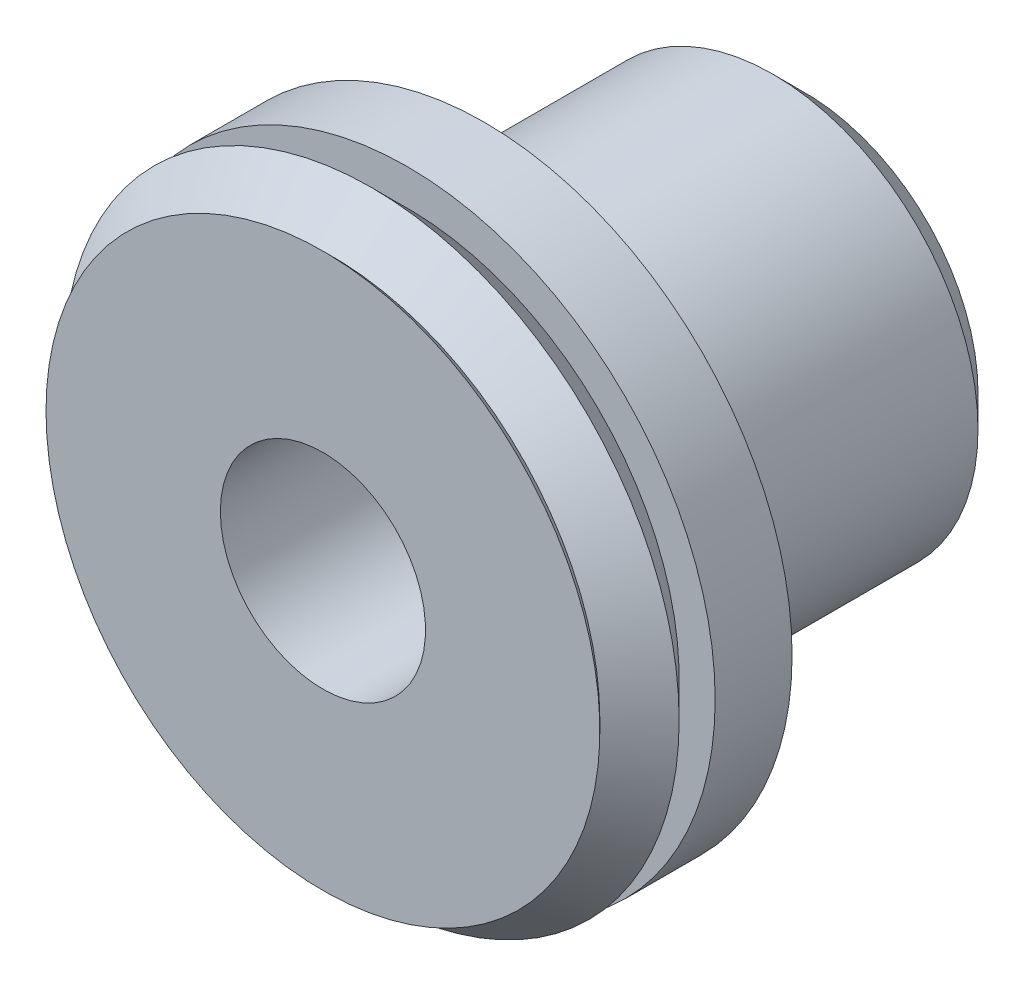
from build123d import *

# Parameters (mm, degrees)
SKETCH15_R                      = 5.08
SINGLE_ACTING_STUD_DEPTH        = 7.9375
SINGLE_ACTING_STUD_CHAMFER_SIZE = 0.79375
SKETCH3_R                       = 2.54
HOLE_CUT_DEPTH                  = 17.08073595


with BuildPart() as part:
    # Sketch1 → Base (revolve)
    with BuildSketch(Plane(origin=(0, 0, 0), x_dir=(0, 0, -1), z_dir=(1, 0, 0)), mode=Mode.PRIVATE) as base_sk:
        Polygon((0, 0), (0, 6.858), (0.21971, 6.63829), (1.20142, 7.62), (2.093214, 6.728206), (2.093214, 7.62), (3.998214, 7.62), (3.998214, 0), align=None)
    revolve(base_sk.sketch.rotate(Axis((0, 0, -71.294124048), (0, 0, 1)), 90), axis=Axis((0, 0, -71.294124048), (0, 0, 1)))

    # Sketch15 → Single Acting Stud (add)
    with BuildSketch(Plane.XY.offset(-3.998214)):
        Circle(SKETCH15_R)
    extrude(amount=-SINGLE_ACTING_STUD_DEPTH)

    # Single Acting Stud Chamfer
    single_acting_stud_chamfer_edges = [part.edges().sort_by_distance(p)[0] for p in [
        (-5.08, 0, -11.935714),
    ]]
    chamfer(single_acting_stud_chamfer_edges, length=SINGLE_ACTING_STUD_CHAMFER_SIZE)

    # Sketch3 → Hole Cut (cut, through all)
    with BuildSketch(Plane(origin=(0, 0, 0), x_dir=(-1, 0, 0), z_dir=(0, 0, -1))):
        Circle(SKETCH3_R)
    extrude(amount=HOLE_CUT_DEPTH, mode=Mode.SUBTRACT)


solid = part.part
